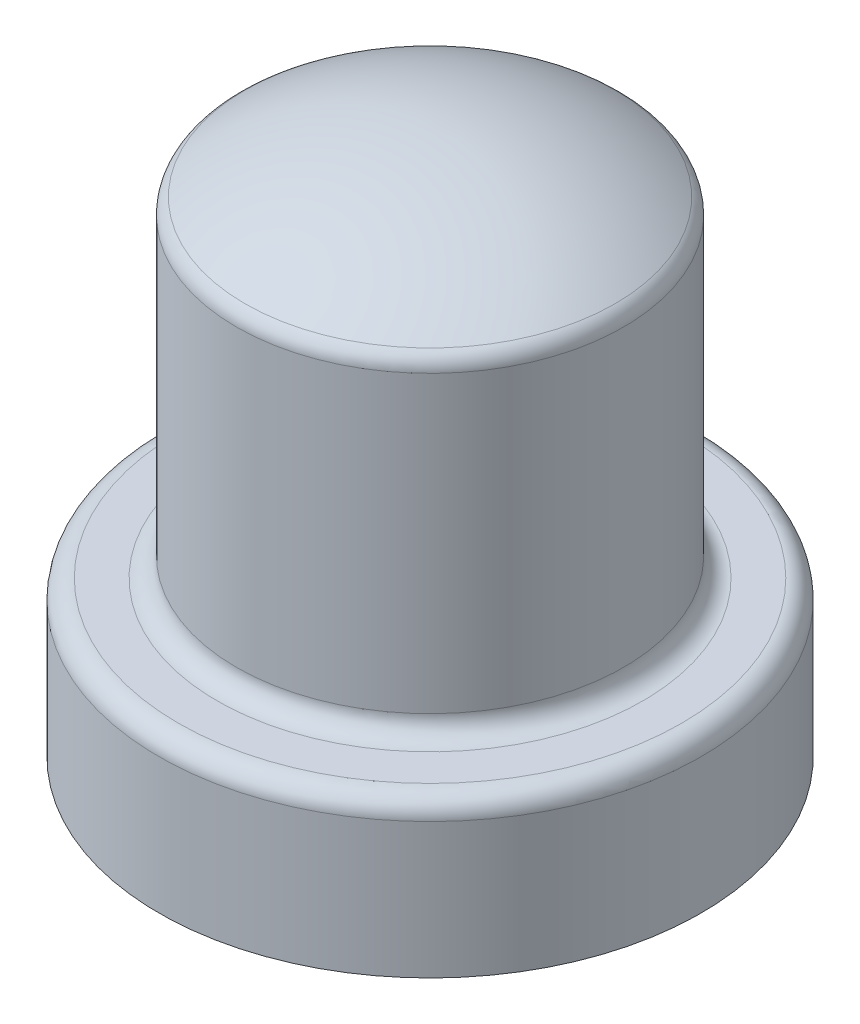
ISO-10303-21;
HEADER;
FILE_DESCRIPTION(('STEP AP214'),'2;1');
FILE_NAME('part.step','',(''),(''),'','','');
FILE_SCHEMA(('AUTOMOTIVE_DESIGN { 1 0 10303 214 1 1 1 1 }'));
ENDSEC;
DATA;
#1=APPLICATION_CONTEXT('core data for automotive mechanical design processes');
#2=APPLICATION_PROTOCOL_DEFINITION('international standard','automotive_design',2000,#1);
#3=PRODUCT_CONTEXT('',#1,'mechanical');
#4=PRODUCT('Part','Part','',(#3));
#5=PRODUCT_RELATED_PRODUCT_CATEGORY('part','',(#4));
#6=PRODUCT_DEFINITION_FORMATION('','',#4);
#7=PRODUCT_DEFINITION_CONTEXT('part definition',#1,'design');
#8=PRODUCT_DEFINITION('design','',#6,#7);
#9=PRODUCT_DEFINITION_SHAPE('','',#8);
#10=(LENGTH_UNIT() NAMED_UNIT(*) SI_UNIT(.MILLI.,.METRE.));
#11=(NAMED_UNIT(*) PLANE_ANGLE_UNIT() SI_UNIT($,.RADIAN.));
#12=(NAMED_UNIT(*) SI_UNIT($,.STERADIAN.) SOLID_ANGLE_UNIT());
#13=UNCERTAINTY_MEASURE_WITH_UNIT(LENGTH_MEASURE(1.E-05),#10,'distance_accuracy_value','');
#14=(GEOMETRIC_REPRESENTATION_CONTEXT(3) GLOBAL_UNCERTAINTY_ASSIGNED_CONTEXT((#13)) GLOBAL_UNIT_ASSIGNED_CONTEXT((#10,
#11,#12)) REPRESENTATION_CONTEXT('',''));
#15=CARTESIAN_POINT('',(0.,0.,0.));
#16=DIRECTION('',(0.,0.,1.));
#17=DIRECTION('',(1.,0.,0.));
#18=AXIS2_PLACEMENT_3D('',#15,#16,#17);
#19=CARTESIAN_POINT('',(0.,-12.2307881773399,0.));
#20=DIRECTION('',(0.,-1.,0.));
#21=DIRECTION('',(0.,0.,-1.));
#22=AXIS2_PLACEMENT_3D('',#19,#20,#21);
#23=CYLINDRICAL_SURFACE('',#22,6.);
#24=CARTESIAN_POINT('',(0.,3.,0.));
#25=DIRECTION('',(0.,-1.,0.));
#26=DIRECTION('',(0.,0.,-1.));
#27=AXIS2_PLACEMENT_3D('',#24,#25,#26);
#28=CIRCLE('',#27,6.);
#29=CARTESIAN_POINT('',(0.,3.,-6.));
#30=VERTEX_POINT('',#29);
#31=EDGE_CURVE('E10',#30,#30,#28,.T.);
#32=ORIENTED_EDGE('',*,*,#31,.F.);
#33=EDGE_LOOP('',(#32));
#34=FACE_BOUND('',#33,.T.);
#35=CARTESIAN_POINT('',(0.,0.,0.));
#36=DIRECTION('',(0.,-1.,0.));
#37=DIRECTION('',(0.,0.,-1.));
#38=AXIS2_PLACEMENT_3D('',#35,#36,#37);
#39=CIRCLE('',#38,6.);
#40=CARTESIAN_POINT('',(0.,0.,-6.));
#41=VERTEX_POINT('',#40);
#42=EDGE_CURVE('E65',#41,#41,#39,.T.);
#43=ORIENTED_EDGE('',*,*,#42,.T.);
#44=EDGE_LOOP('',(#43));
#45=FACE_BOUND('',#44,.T.);
#46=ADVANCED_FACE('F28',(#34,#45),#23,.F.);
#47=CARTESIAN_POINT('',(-6.,3.,0.));
#48=DIRECTION('',(0.,1.,0.));
#49=DIRECTION('',(0.,0.,1.));
#50=AXIS2_PLACEMENT_3D('',#47,#48,#49);
#51=PLANE('',#50);
#52=CARTESIAN_POINT('',(0.,3.,0.));
#53=DIRECTION('',(0.,-1.,0.));
#54=DIRECTION('',(0.,0.,-1.));
#55=AXIS2_PLACEMENT_3D('',#52,#53,#54);
#56=CIRCLE('',#55,4.);
#57=CARTESIAN_POINT('',(0.,3.,-4.));
#58=VERTEX_POINT('',#57);
#59=EDGE_CURVE('E34',#58,#58,#56,.T.);
#60=ORIENTED_EDGE('',*,*,#59,.F.);
#61=EDGE_LOOP('',(#60));
#62=FACE_BOUND('',#61,.T.);
#63=ORIENTED_EDGE('',*,*,#31,.T.);
#64=EDGE_LOOP('',(#63));
#65=FACE_BOUND('',#64,.T.);
#66=ADVANCED_FACE('F123',(#62,#65),#51,.F.);
#67=CARTESIAN_POINT('',(0.,-12.2307881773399,0.));
#68=DIRECTION('',(0.,-1.,0.));
#69=DIRECTION('',(0.,0.,-1.));
#70=AXIS2_PLACEMENT_3D('',#67,#68,#69);
#71=CYLINDRICAL_SURFACE('',#70,4.);
#72=CARTESIAN_POINT('',(0.,11.8442887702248,0.));
#73=DIRECTION('',(0.,-1.,0.));
#74=DIRECTION('',(0.,0.,-1.));
#75=AXIS2_PLACEMENT_3D('',#72,#73,#74);
#76=CIRCLE('',#75,4.);
#77=CARTESIAN_POINT('',(0.,11.8442887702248,-4.));
#78=VERTEX_POINT('',#77);
#79=EDGE_CURVE('E38',#78,#78,#76,.T.);
#80=ORIENTED_EDGE('',*,*,#79,.F.);
#81=EDGE_LOOP('',(#80));
#82=FACE_BOUND('',#81,.T.);
#83=ORIENTED_EDGE('',*,*,#59,.T.);
#84=EDGE_LOOP('',(#83));
#85=FACE_BOUND('',#84,.T.);
#86=ADVANCED_FACE('F119',(#82,#85),#71,.F.);
#87=CARTESIAN_POINT('',(0.,5.5,0.));
#88=DIRECTION('',(0.,-1.,0.));
#89=DIRECTION('',(-1.,0.,0.));
#90=AXIS2_PLACEMENT_3D('',#87,#88,#89);
#91=SPHERICAL_SURFACE('',#90,7.5);
#92=ORIENTED_EDGE('',*,*,#79,.T.);
#93=EDGE_LOOP('',(#92));
#94=FACE_BOUND('',#93,.T.);
#95=ADVANCED_FACE('F114',(#94),#91,.F.);
#96=CARTESIAN_POINT('',(0.,5.5,0.));
#97=DIRECTION('',(0.,-1.,0.));
#98=DIRECTION('',(1.,0.,0.));
#99=AXIS2_PLACEMENT_3D('',#96,#97,#98);
#100=SPHERICAL_SURFACE('',#99,8.5);
#101=CARTESIAN_POINT('',(0.,12.5277769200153,0.));
#102=DIRECTION('',(0.,-1.,0.));
#103=DIRECTION('',(0.,0.,-1.));
#104=AXIS2_PLACEMENT_3D('',#101,#102,#103);
#105=CIRCLE('',#104,4.78125);
#106=CARTESIAN_POINT('',(0.,12.5277769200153,-4.78125));
#107=VERTEX_POINT('',#106);
#108=EDGE_CURVE('E42',#107,#107,#105,.T.);
#109=ORIENTED_EDGE('',*,*,#108,.F.);
#110=EDGE_LOOP('',(#109));
#111=FACE_BOUND('',#110,.T.);
#112=ADVANCED_FACE('F109',(#111),#100,.T.);
#113=CARTESIAN_POINT('',(0.,12.1143782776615,0.));
#114=DIRECTION('',(0.,-1.,0.));
#115=DIRECTION('',(0.,0.,-1.));
#116=AXIS2_PLACEMENT_3D('',#113,#114,#115);
#117=TOROIDAL_SURFACE('',#116,4.5,0.499999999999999);
#118=CARTESIAN_POINT('',(0.,12.1143782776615,0.));
#119=DIRECTION('',(0.,-1.,0.));
#120=DIRECTION('',(0.,0.,-1.));
#121=AXIS2_PLACEMENT_3D('',#118,#119,#120);
#122=CIRCLE('',#121,5.);
#123=CARTESIAN_POINT('',(0.,12.1143782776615,-5.));
#124=VERTEX_POINT('',#123);
#125=EDGE_CURVE('E47',#124,#124,#122,.T.);
#126=ORIENTED_EDGE('',*,*,#125,.F.);
#127=EDGE_LOOP('',(#126));
#128=FACE_BOUND('',#127,.T.);
#129=ORIENTED_EDGE('',*,*,#108,.T.);
#130=EDGE_LOOP('',(#129));
#131=FACE_BOUND('',#130,.T.);
#132=ADVANCED_FACE('F103',(#128,#131),#117,.T.);
#133=CARTESIAN_POINT('',(0.,-12.2307881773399,0.));
#134=DIRECTION('',(0.,-1.,0.));
#135=DIRECTION('',(0.,0.,-1.));
#136=AXIS2_PLACEMENT_3D('',#133,#134,#135);
#137=CYLINDRICAL_SURFACE('',#136,5.);
#138=CARTESIAN_POINT('',(0.,4.5,0.));
#139=DIRECTION('',(0.,-1.,0.));
#140=DIRECTION('',(0.,0.,-1.));
#141=AXIS2_PLACEMENT_3D('',#138,#139,#140);
#142=CIRCLE('',#141,5.);
#143=CARTESIAN_POINT('',(0.,4.5,-5.));
#144=VERTEX_POINT('',#143);
#145=EDGE_CURVE('E50',#144,#144,#142,.T.);
#146=ORIENTED_EDGE('',*,*,#145,.F.);
#147=EDGE_LOOP('',(#146));
#148=FACE_BOUND('',#147,.T.);
#149=ORIENTED_EDGE('',*,*,#125,.T.);
#150=EDGE_LOOP('',(#149));
#151=FACE_BOUND('',#150,.T.);
#152=ADVANCED_FACE('F97',(#148,#151),#137,.T.);
#153=CARTESIAN_POINT('',(0.,4.5,0.));
#154=DIRECTION('',(0.,-1.,0.));
#155=DIRECTION('',(0.,0.,-1.));
#156=AXIS2_PLACEMENT_3D('',#153,#154,#155);
#157=TOROIDAL_SURFACE('',#156,5.5,0.499999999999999);
#158=CARTESIAN_POINT('',(0.,4.,0.));
#159=DIRECTION('',(0.,-1.,0.));
#160=DIRECTION('',(0.,0.,-1.));
#161=AXIS2_PLACEMENT_3D('',#158,#159,#160);
#162=CIRCLE('',#161,5.5);
#163=CARTESIAN_POINT('',(0.,4.,-5.5));
#164=VERTEX_POINT('',#163);
#165=EDGE_CURVE('E53',#164,#164,#162,.T.);
#166=ORIENTED_EDGE('',*,*,#165,.F.);
#167=EDGE_LOOP('',(#166));
#168=FACE_BOUND('',#167,.T.);
#169=ORIENTED_EDGE('',*,*,#145,.T.);
#170=EDGE_LOOP('',(#169));
#171=FACE_BOUND('',#170,.T.);
#172=ADVANCED_FACE('F91',(#168,#171),#157,.F.);
#173=CARTESIAN_POINT('',(-6.5,4.,0.));
#174=DIRECTION('',(0.,-1.,0.));
#175=DIRECTION('',(0.,0.,-1.));
#176=AXIS2_PLACEMENT_3D('',#173,#174,#175);
#177=PLANE('',#176);
#178=CARTESIAN_POINT('',(0.,4.,0.));
#179=DIRECTION('',(0.,-1.,0.));
#180=DIRECTION('',(0.,0.,-1.));
#181=AXIS2_PLACEMENT_3D('',#178,#179,#180);
#182=CIRCLE('',#181,6.5);
#183=CARTESIAN_POINT('',(0.,4.,-6.5));
#184=VERTEX_POINT('',#183);
#185=EDGE_CURVE('E56',#184,#184,#182,.T.);
#186=ORIENTED_EDGE('',*,*,#185,.F.);
#187=EDGE_LOOP('',(#186));
#188=FACE_BOUND('',#187,.T.);
#189=ORIENTED_EDGE('',*,*,#165,.T.);
#190=EDGE_LOOP('',(#189));
#191=FACE_BOUND('',#190,.T.);
#192=ADVANCED_FACE('F85',(#188,#191),#177,.F.);
#193=CARTESIAN_POINT('',(0.,3.5,0.));
#194=DIRECTION('',(0.,-1.,0.));
#195=DIRECTION('',(0.,0.,-1.));
#196=AXIS2_PLACEMENT_3D('',#193,#194,#195);
#197=TOROIDAL_SURFACE('',#196,6.5,0.5);
#198=CARTESIAN_POINT('',(0.,3.5,0.));
#199=DIRECTION('',(0.,-1.,0.));
#200=DIRECTION('',(0.,0.,-1.));
#201=AXIS2_PLACEMENT_3D('',#198,#199,#200);
#202=CIRCLE('',#201,7.);
#203=CARTESIAN_POINT('',(0.,3.5,-7.));
#204=VERTEX_POINT('',#203);
#205=EDGE_CURVE('E59',#204,#204,#202,.T.);
#206=ORIENTED_EDGE('',*,*,#205,.F.);
#207=EDGE_LOOP('',(#206));
#208=FACE_BOUND('',#207,.T.);
#209=ORIENTED_EDGE('',*,*,#185,.T.);
#210=EDGE_LOOP('',(#209));
#211=FACE_BOUND('',#210,.T.);
#212=ADVANCED_FACE('F79',(#208,#211),#197,.T.);
#213=CARTESIAN_POINT('',(0.,-12.2307881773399,0.));
#214=DIRECTION('',(0.,-1.,0.));
#215=DIRECTION('',(0.,0.,-1.));
#216=AXIS2_PLACEMENT_3D('',#213,#214,#215);
#217=CYLINDRICAL_SURFACE('',#216,7.);
#218=CARTESIAN_POINT('',(0.,0.,0.));
#219=DIRECTION('',(0.,-1.,0.));
#220=DIRECTION('',(0.,0.,-1.));
#221=AXIS2_PLACEMENT_3D('',#218,#219,#220);
#222=CIRCLE('',#221,7.);
#223=CARTESIAN_POINT('',(0.,0.,-7.));
#224=VERTEX_POINT('',#223);
#225=EDGE_CURVE('E62',#224,#224,#222,.T.);
#226=ORIENTED_EDGE('',*,*,#225,.F.);
#227=EDGE_LOOP('',(#226));
#228=FACE_BOUND('',#227,.T.);
#229=ORIENTED_EDGE('',*,*,#205,.T.);
#230=EDGE_LOOP('',(#229));
#231=FACE_BOUND('',#230,.T.);
#232=ADVANCED_FACE('F73',(#228,#231),#217,.T.);
#233=CARTESIAN_POINT('',(-6.,0.,0.));
#234=DIRECTION('',(0.,1.,0.));
#235=DIRECTION('',(0.,0.,1.));
#236=AXIS2_PLACEMENT_3D('',#233,#234,#235);
#237=PLANE('',#236);
#238=ORIENTED_EDGE('',*,*,#42,.F.);
#239=EDGE_LOOP('',(#238));
#240=FACE_BOUND('',#239,.T.);
#241=ORIENTED_EDGE('',*,*,#225,.T.);
#242=EDGE_LOOP('',(#241));
#243=FACE_BOUND('',#242,.T.);
#244=ADVANCED_FACE('F70',(#240,#243),#237,.F.);
#245=CLOSED_SHELL('',(#46,#66,#86,#95,#112,#132,#152,#172,#192,#212,#232,#244));
#246=MANIFOLD_SOLID_BREP('B2',#245);
#247=ADVANCED_BREP_SHAPE_REPRESENTATION('',(#18,#246),#14);
#248=SHAPE_DEFINITION_REPRESENTATION(#9,#247);
ENDSEC;
END-ISO-10303-21;
